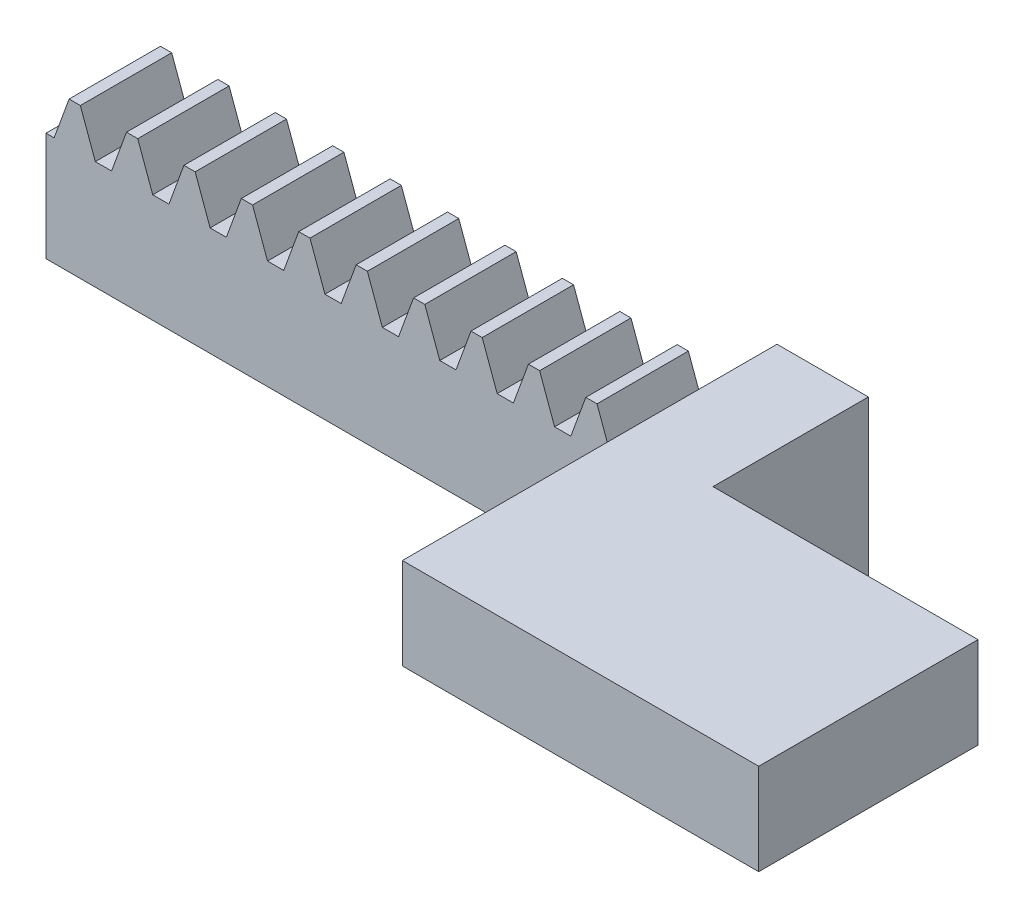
from build123d import *

# Parameters (mm, degrees)
BLANKSKE_W          = 40
BLANKSKE_H          = 8.2
BLANK_DEPTH         = 5
TOOTHCUTSIM_DEPTH   = 42.136844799
TEETHCUTS_COUNT     = 14
TEETHCUTS_PITCH     = 3.14159265
SKETCH1_W           = 4.99804548
SKETCH1_H           = 2.25
BOSS_EXTRUDE1_DEPTH = 5
SKETCH3_W           = 4.99804548
SKETCH3_H           = 2.25
BOSS_EXTRUDE2_DEPTH = 15.5
SKETCH4_W           = 12
SKETCH4_H           = 2.25
BOSS_EXTRUDE4_DEPTH = 14.5
BOSS_EXTRUDE5_DEPTH = 2.75


with BuildPart() as part:
    # BlankSke → Blank (new body)
    with BuildSketch(Plane.XY):
        with Locations((20, 4.1)):
            Rectangle(BLANKSKE_W, BLANKSKE_H)
    extrude(amount=-BLANK_DEPTH)

    # TooCutSkeSim → ToothCutSim (cut, through all)
    with BuildSketch(Plane.XY):
        Polygon((0.44443537, 5.95), (-0.44443537, 5.95), (-1.272613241, 8.2254), (1.272613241, 8.2254), align=None)
    toothcutsim = extrude(amount=-TOOTHCUTSIM_DEPTH, mode=Mode.SUBTRACT)

    # TeethCuts: ToothCutSim ×14
    with Locations(*[(i * TEETHCUTS_PITCH, 0, 0) for i in range(1, TEETHCUTS_COUNT)]):
        add(toothcutsim, mode=Mode.SUBTRACT)

    # Sketch1 → Boss-Extrude1 (add)
    with BuildSketch(Plane.XY):
        with Locations((37.50097726, 7.075)):
            Rectangle(SKETCH1_W, SKETCH1_H)
    extrude(amount=-BOSS_EXTRUDE1_DEPTH)

    # Sketch3 → Boss-Extrude2 (add)
    with BuildSketch(Plane.XY):
        with Locations((37.50097726, 7.075)):
            Rectangle(SKETCH3_W, SKETCH3_H)
    extrude(amount=BOSS_EXTRUDE2_DEPTH)

    # Sketch4 → Boss-Extrude4 (add)
    with BuildSketch(Plane(origin=(40, 0, 0), x_dir=(0, 0, -1), z_dir=(1, 0, 0))):
        with Locations((-9.5, 7.075)):
            Rectangle(SKETCH4_W, SKETCH4_H)
    extrude(amount=BOSS_EXTRUDE4_DEPTH)

    # Sketch6 → Boss-Extrude5 (add)
    with BuildSketch(Plane(origin=(0, 8.2, 0), x_dir=(1, 0, 0), z_dir=(0, 1, 0))):
        Polygon((35.00195452, 5), (35.00195452, -15.5), (54.5, -15.5), (54.5, -3.5), (40, -3.5), (40, 5), align=None)
    extrude(amount=BOSS_EXTRUDE5_DEPTH)


solid = part.part
